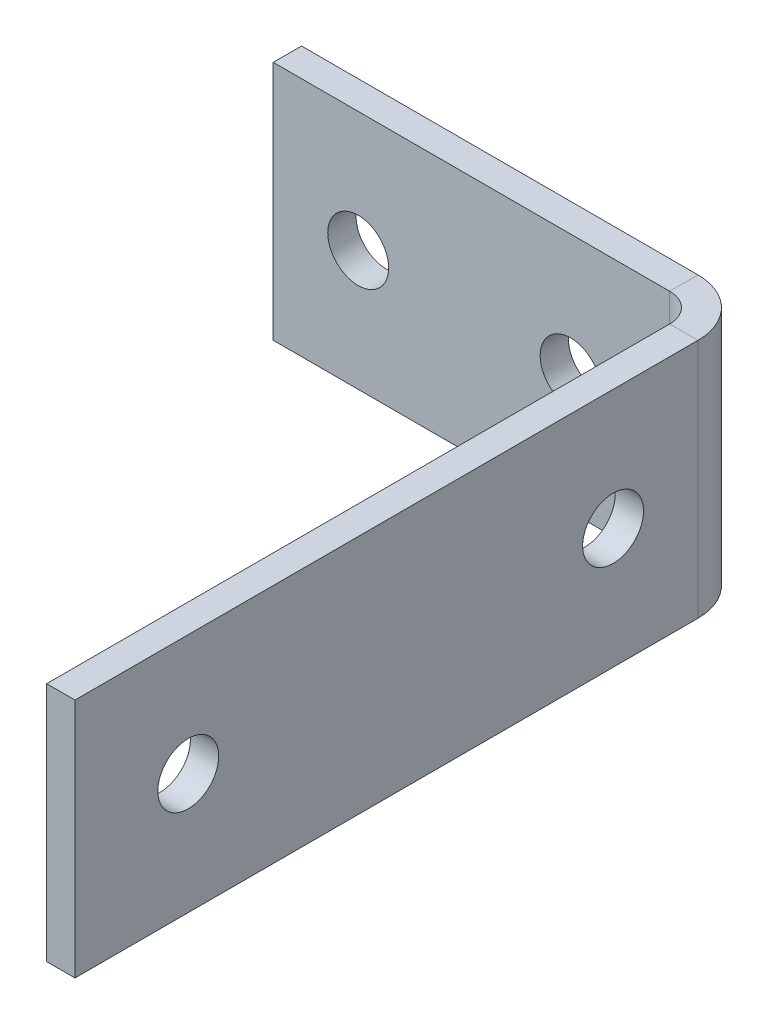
ISO-10303-21;
HEADER;
FILE_DESCRIPTION(('STEP AP214'),'2;1');
FILE_NAME('part.step','',(''),(''),'','','');
FILE_SCHEMA(('AUTOMOTIVE_DESIGN { 1 0 10303 214 1 1 1 1 }'));
ENDSEC;
DATA;
#1=APPLICATION_CONTEXT('core data for automotive mechanical design processes');
#2=APPLICATION_PROTOCOL_DEFINITION('international standard','automotive_design',2000,#1);
#3=PRODUCT_CONTEXT('',#1,'mechanical');
#4=PRODUCT('Part','Part','',(#3));
#5=PRODUCT_RELATED_PRODUCT_CATEGORY('part','',(#4));
#6=PRODUCT_DEFINITION_FORMATION('','',#4);
#7=PRODUCT_DEFINITION_CONTEXT('part definition',#1,'design');
#8=PRODUCT_DEFINITION('design','',#6,#7);
#9=PRODUCT_DEFINITION_SHAPE('','',#8);
#10=(LENGTH_UNIT() NAMED_UNIT(*) SI_UNIT(.MILLI.,.METRE.));
#11=(NAMED_UNIT(*) PLANE_ANGLE_UNIT() SI_UNIT($,.RADIAN.));
#12=(NAMED_UNIT(*) SI_UNIT($,.STERADIAN.) SOLID_ANGLE_UNIT());
#13=UNCERTAINTY_MEASURE_WITH_UNIT(LENGTH_MEASURE(1.E-05),#10,'distance_accuracy_value','');
#14=(GEOMETRIC_REPRESENTATION_CONTEXT(3) GLOBAL_UNCERTAINTY_ASSIGNED_CONTEXT((#13)) GLOBAL_UNIT_ASSIGNED_CONTEXT((#10,
#11,#12)) REPRESENTATION_CONTEXT('',''));
#15=CARTESIAN_POINT('',(0.,0.,0.));
#16=DIRECTION('',(0.,0.,1.));
#17=DIRECTION('',(1.,0.,0.));
#18=AXIS2_PLACEMENT_3D('',#15,#16,#17);
#19=CARTESIAN_POINT('',(-16.,8.5,-2.));
#20=DIRECTION('',(0.,1.,0.));
#21=DIRECTION('',(0.,0.,1.));
#22=AXIS2_PLACEMENT_3D('',#19,#20,#21);
#23=PLANE('',#22);
#24=DIRECTION('',(-1.,0.,0.));
#25=VECTOR('',#24,1.);
#26=CARTESIAN_POINT('',(-16.,8.5,0.));
#27=LINE('',#26,#25);
#28=CARTESIAN_POINT('',(12.,8.5,0.));
#29=VERTEX_POINT('',#28);
#30=CARTESIAN_POINT('',(-16.,8.5,0.));
#31=VERTEX_POINT('',#30);
#32=EDGE_CURVE('E101',#29,#31,#27,.T.);
#33=ORIENTED_EDGE('',*,*,#32,.F.);
#34=DIRECTION('',(0.,0.,-1.));
#35=VECTOR('',#34,1.);
#36=CARTESIAN_POINT('',(12.,8.5,0.));
#37=LINE('',#36,#35);
#38=CARTESIAN_POINT('',(12.,8.5,-2.));
#39=VERTEX_POINT('',#38);
#40=EDGE_CURVE('E116',#29,#39,#37,.T.);
#41=ORIENTED_EDGE('',*,*,#40,.T.);
#42=DIRECTION('',(-1.,0.,0.));
#43=VECTOR('',#42,1.);
#44=CARTESIAN_POINT('',(-16.,8.5,-2.));
#45=LINE('',#44,#43);
#46=CARTESIAN_POINT('',(-16.,8.5,-2.));
#47=VERTEX_POINT('',#46);
#48=EDGE_CURVE('E108',#39,#47,#45,.T.);
#49=ORIENTED_EDGE('',*,*,#48,.T.);
#50=DIRECTION('',(0.,0.,1.));
#51=VECTOR('',#50,1.);
#52=CARTESIAN_POINT('',(-16.,8.5,-2.));
#53=LINE('',#52,#51);
#54=EDGE_CURVE('E62',#47,#31,#53,.T.);
#55=ORIENTED_EDGE('',*,*,#54,.T.);
#56=EDGE_LOOP('',(#33,#41,#49,#55));
#57=FACE_BOUND('',#56,.T.);
#58=ADVANCED_FACE('F59',(#57),#23,.T.);
#59=CARTESIAN_POINT('',(0.,0.,-2.));
#60=DIRECTION('',(0.,0.,1.));
#61=DIRECTION('',(1.,0.,0.));
#62=AXIS2_PLACEMENT_3D('',#59,#60,#61);
#63=PLANE('',#62);
#64=CARTESIAN_POINT('',(-9.99999999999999,0.,-2.));
#65=DIRECTION('',(0.,0.,-1.));
#66=DIRECTION('',(-1.,0.,0.));
#67=AXIS2_PLACEMENT_3D('',#64,#65,#66);
#68=CIRCLE('',#67,2.15);
#69=CARTESIAN_POINT('',(-12.15,0.,-2.));
#70=VERTEX_POINT('',#69);
#71=EDGE_CURVE('E176',#70,#70,#68,.T.);
#72=ORIENTED_EDGE('',*,*,#71,.F.);
#73=EDGE_LOOP('',(#72));
#74=FACE_BOUND('',#73,.T.);
#75=CARTESIAN_POINT('',(5.00000000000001,0.,-2.));
#76=DIRECTION('',(0.,0.,-1.));
#77=DIRECTION('',(-1.,0.,0.));
#78=AXIS2_PLACEMENT_3D('',#75,#76,#77);
#79=CIRCLE('',#78,2.15);
#80=CARTESIAN_POINT('',(2.85000000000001,0.,-2.));
#81=VERTEX_POINT('',#80);
#82=EDGE_CURVE('E141',#81,#81,#79,.T.);
#83=ORIENTED_EDGE('',*,*,#82,.F.);
#84=EDGE_LOOP('',(#83));
#85=FACE_BOUND('',#84,.T.);
#86=DIRECTION('',(0.,1.,0.));
#87=VECTOR('',#86,1.);
#88=CARTESIAN_POINT('',(12.,8.5,-2.));
#89=LINE('',#88,#87);
#90=CARTESIAN_POINT('',(12.,-8.49999999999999,-2.));
#91=VERTEX_POINT('',#90);
#92=EDGE_CURVE('E132',#39,#91,#89,.F.);
#93=ORIENTED_EDGE('',*,*,#92,.T.);
#94=DIRECTION('',(1.,0.,0.));
#95=VECTOR('',#94,1.);
#96=CARTESIAN_POINT('',(-16.,-8.5,-2.));
#97=LINE('',#96,#95);
#98=CARTESIAN_POINT('',(-16.,-8.5,-2.));
#99=VERTEX_POINT('',#98);
#100=EDGE_CURVE('E113',#99,#91,#97,.T.);
#101=ORIENTED_EDGE('',*,*,#100,.F.);
#102=DIRECTION('',(0.,-1.,0.));
#103=VECTOR('',#102,1.);
#104=CARTESIAN_POINT('',(-16.,8.5,-2.));
#105=LINE('',#104,#103);
#106=EDGE_CURVE('E96',#47,#99,#105,.T.);
#107=ORIENTED_EDGE('',*,*,#106,.F.);
#108=ORIENTED_EDGE('',*,*,#48,.F.);
#109=EDGE_LOOP('',(#93,#101,#107,#108));
#110=FACE_BOUND('',#109,.T.);
#111=ADVANCED_FACE('F245',(#74,#85,#110),#63,.F.);
#112=CARTESIAN_POINT('',(0.,0.,0.));
#113=DIRECTION('',(0.,0.,1.));
#114=DIRECTION('',(1.,0.,0.));
#115=AXIS2_PLACEMENT_3D('',#112,#113,#114);
#116=PLANE('',#115);
#117=CARTESIAN_POINT('',(-9.99999999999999,0.,0.));
#118=DIRECTION('',(0.,0.,1.));
#119=DIRECTION('',(1.,0.,0.));
#120=AXIS2_PLACEMENT_3D('',#117,#118,#119);
#121=CIRCLE('',#120,2.15);
#122=CARTESIAN_POINT('',(-7.84999999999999,0.,0.));
#123=VERTEX_POINT('',#122);
#124=EDGE_CURVE('E179',#123,#123,#121,.F.);
#125=ORIENTED_EDGE('',*,*,#124,.T.);
#126=EDGE_LOOP('',(#125));
#127=FACE_BOUND('',#126,.T.);
#128=CARTESIAN_POINT('',(5.00000000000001,0.,0.));
#129=DIRECTION('',(0.,0.,1.));
#130=DIRECTION('',(1.,0.,0.));
#131=AXIS2_PLACEMENT_3D('',#128,#129,#130);
#132=CIRCLE('',#131,2.15);
#133=CARTESIAN_POINT('',(7.15000000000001,0.,0.));
#134=VERTEX_POINT('',#133);
#135=EDGE_CURVE('E173',#134,#134,#132,.F.);
#136=ORIENTED_EDGE('',*,*,#135,.T.);
#137=EDGE_LOOP('',(#136));
#138=FACE_BOUND('',#137,.T.);
#139=DIRECTION('',(1.,0.,0.));
#140=VECTOR('',#139,1.);
#141=CARTESIAN_POINT('',(-16.,-8.5,0.));
#142=LINE('',#141,#140);
#143=CARTESIAN_POINT('',(-16.,-8.5,0.));
#144=VERTEX_POINT('',#143);
#145=CARTESIAN_POINT('',(12.,-8.5,0.));
#146=VERTEX_POINT('',#145);
#147=EDGE_CURVE('E100',#144,#146,#142,.T.);
#148=ORIENTED_EDGE('',*,*,#147,.T.);
#149=DIRECTION('',(0.,1.,0.));
#150=VECTOR('',#149,1.);
#151=CARTESIAN_POINT('',(12.,8.5,0.));
#152=LINE('',#151,#150);
#153=EDGE_CURVE('E73',#29,#146,#152,.F.);
#154=ORIENTED_EDGE('',*,*,#153,.F.);
#155=ORIENTED_EDGE('',*,*,#32,.T.);
#156=DIRECTION('',(0.,-1.,0.));
#157=VECTOR('',#156,1.);
#158=CARTESIAN_POINT('',(-16.,8.5,0.));
#159=LINE('',#158,#157);
#160=EDGE_CURVE('E94',#31,#144,#159,.T.);
#161=ORIENTED_EDGE('',*,*,#160,.T.);
#162=EDGE_LOOP('',(#148,#154,#155,#161));
#163=FACE_BOUND('',#162,.T.);
#164=ADVANCED_FACE('F98',(#127,#138,#163),#116,.T.);
#165=CARTESIAN_POINT('',(-16.,-8.5,-2.));
#166=DIRECTION('',(0.,-1.,0.));
#167=DIRECTION('',(0.,0.,-1.));
#168=AXIS2_PLACEMENT_3D('',#165,#166,#167);
#169=PLANE('',#168);
#170=DIRECTION('',(0.,0.,-1.));
#171=VECTOR('',#170,1.);
#172=CARTESIAN_POINT('',(12.,-8.5,0.));
#173=LINE('',#172,#171);
#174=EDGE_CURVE('E107',#146,#91,#173,.T.);
#175=ORIENTED_EDGE('',*,*,#174,.F.);
#176=ORIENTED_EDGE('',*,*,#147,.F.);
#177=DIRECTION('',(0.,0.,1.));
#178=VECTOR('',#177,1.);
#179=CARTESIAN_POINT('',(-16.,-8.5,-2.));
#180=LINE('',#179,#178);
#181=EDGE_CURVE('E13',#99,#144,#180,.T.);
#182=ORIENTED_EDGE('',*,*,#181,.F.);
#183=ORIENTED_EDGE('',*,*,#100,.T.);
#184=EDGE_LOOP('',(#175,#176,#182,#183));
#185=FACE_BOUND('',#184,.T.);
#186=ADVANCED_FACE('F105',(#185),#169,.T.);
#187=CARTESIAN_POINT('',(-16.,8.5,-2.));
#188=DIRECTION('',(-1.,0.,0.));
#189=DIRECTION('',(0.,0.,1.));
#190=AXIS2_PLACEMENT_3D('',#187,#188,#189);
#191=PLANE('',#190);
#192=ORIENTED_EDGE('',*,*,#160,.F.);
#193=ORIENTED_EDGE('',*,*,#54,.F.);
#194=ORIENTED_EDGE('',*,*,#106,.T.);
#195=ORIENTED_EDGE('',*,*,#181,.T.);
#196=EDGE_LOOP('',(#192,#193,#194,#195));
#197=FACE_BOUND('',#196,.T.);
#198=ADVANCED_FACE('F92',(#197),#191,.T.);
#199=CARTESIAN_POINT('',(12.,-8.5,2.));
#200=DIRECTION('',(0.,-1.,0.));
#201=DIRECTION('',(0.,0.,-1.));
#202=AXIS2_PLACEMENT_3D('',#199,#200,#201);
#203=PLANE('',#202);
#204=DIRECTION('',(-1.,0.,0.));
#205=VECTOR('',#204,1.);
#206=CARTESIAN_POINT('',(16.,-8.5,1.99999999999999));
#207=LINE('',#206,#205);
#208=CARTESIAN_POINT('',(14.,-8.5,1.99999999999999));
#209=VERTEX_POINT('',#208);
#210=CARTESIAN_POINT('',(16.,-8.5,1.99999999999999));
#211=VERTEX_POINT('',#210);
#212=EDGE_CURVE('E137',#209,#211,#207,.F.);
#213=ORIENTED_EDGE('',*,*,#212,.F.);
#214=CARTESIAN_POINT('',(12.,-8.5,2.));
#215=DIRECTION('',(0.,1.,0.));
#216=DIRECTION('',(0.,0.,1.));
#217=AXIS2_PLACEMENT_3D('',#214,#215,#216);
#218=CIRCLE('',#217,2.);
#219=EDGE_CURVE('E126',#146,#209,#218,.F.);
#220=ORIENTED_EDGE('',*,*,#219,.F.);
#221=ORIENTED_EDGE('',*,*,#174,.T.);
#222=CARTESIAN_POINT('',(12.,-8.5,2.));
#223=DIRECTION('',(0.,1.,0.));
#224=DIRECTION('',(0.,0.,1.));
#225=AXIS2_PLACEMENT_3D('',#222,#223,#224);
#226=CIRCLE('',#225,4.);
#227=EDGE_CURVE('E119',#91,#211,#226,.F.);
#228=ORIENTED_EDGE('',*,*,#227,.T.);
#229=EDGE_LOOP('',(#213,#220,#221,#228));
#230=FACE_BOUND('',#229,.T.);
#231=ADVANCED_FACE('F248',(#230),#203,.T.);
#232=CARTESIAN_POINT('',(12.,8.5,2.));
#233=DIRECTION('',(0.,-1.,0.));
#234=DIRECTION('',(0.,0.,-1.));
#235=AXIS2_PLACEMENT_3D('',#232,#233,#234);
#236=PLANE('',#235);
#237=CARTESIAN_POINT('',(12.,8.5,2.));
#238=DIRECTION('',(0.,1.,0.));
#239=DIRECTION('',(0.,0.,1.));
#240=AXIS2_PLACEMENT_3D('',#237,#238,#239);
#241=CIRCLE('',#240,2.);
#242=CARTESIAN_POINT('',(14.,8.5,1.99999999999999));
#243=VERTEX_POINT('',#242);
#244=EDGE_CURVE('E121',#243,#29,#241,.T.);
#245=ORIENTED_EDGE('',*,*,#244,.F.);
#246=DIRECTION('',(-1.,0.,0.));
#247=VECTOR('',#246,1.);
#248=CARTESIAN_POINT('',(14.,8.5,1.99999999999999));
#249=LINE('',#248,#247);
#250=CARTESIAN_POINT('',(16.,8.5,1.99999999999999));
#251=VERTEX_POINT('',#250);
#252=EDGE_CURVE('E144',#243,#251,#249,.F.);
#253=ORIENTED_EDGE('',*,*,#252,.T.);
#254=CARTESIAN_POINT('',(12.,8.5,2.));
#255=DIRECTION('',(0.,1.,0.));
#256=DIRECTION('',(0.,0.,1.));
#257=AXIS2_PLACEMENT_3D('',#254,#255,#256);
#258=CIRCLE('',#257,4.);
#259=EDGE_CURVE('E129',#251,#39,#258,.T.);
#260=ORIENTED_EDGE('',*,*,#259,.T.);
#261=ORIENTED_EDGE('',*,*,#40,.F.);
#262=EDGE_LOOP('',(#245,#253,#260,#261));
#263=FACE_BOUND('',#262,.T.);
#264=ADVANCED_FACE('F252',(#263),#236,.F.);
#265=CARTESIAN_POINT('',(12.,8.5,2.));
#266=DIRECTION('',(0.,1.,0.));
#267=DIRECTION('',(1.,0.,0.));
#268=AXIS2_PLACEMENT_3D('',#265,#266,#267);
#269=CYLINDRICAL_SURFACE('',#268,4.);
#270=ORIENTED_EDGE('',*,*,#92,.F.);
#271=ORIENTED_EDGE('',*,*,#259,.F.);
#272=DIRECTION('',(0.,1.,0.));
#273=VECTOR('',#272,1.);
#274=CARTESIAN_POINT('',(16.,-8.5,1.99999999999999));
#275=LINE('',#274,#273);
#276=EDGE_CURVE('E147',#251,#211,#275,.F.);
#277=ORIENTED_EDGE('',*,*,#276,.T.);
#278=ORIENTED_EDGE('',*,*,#227,.F.);
#279=EDGE_LOOP('',(#270,#271,#277,#278));
#280=FACE_BOUND('',#279,.T.);
#281=ADVANCED_FACE('F249',(#280),#269,.T.);
#282=CARTESIAN_POINT('',(12.,8.5,2.));
#283=DIRECTION('',(0.,1.,0.));
#284=DIRECTION('',(1.,0.,0.));
#285=AXIS2_PLACEMENT_3D('',#282,#283,#284);
#286=CYLINDRICAL_SURFACE('',#285,2.);
#287=ORIENTED_EDGE('',*,*,#153,.T.);
#288=ORIENTED_EDGE('',*,*,#219,.T.);
#289=DIRECTION('',(0.,1.,0.));
#290=VECTOR('',#289,1.);
#291=CARTESIAN_POINT('',(14.,-8.5,1.99999999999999));
#292=LINE('',#291,#290);
#293=EDGE_CURVE('E140',#209,#243,#292,.T.);
#294=ORIENTED_EDGE('',*,*,#293,.T.);
#295=ORIENTED_EDGE('',*,*,#244,.T.);
#296=EDGE_LOOP('',(#287,#288,#294,#295));
#297=FACE_BOUND('',#296,.T.);
#298=ADVANCED_FACE('F251',(#297),#286,.F.);
#299=CARTESIAN_POINT('',(16.,-8.5,0.));
#300=DIRECTION('',(0.,1.,0.));
#301=DIRECTION('',(0.,0.,1.));
#302=AXIS2_PLACEMENT_3D('',#299,#300,#301);
#303=PLANE('',#302);
#304=ORIENTED_EDGE('',*,*,#212,.T.);
#305=DIRECTION('',(0.,0.,-1.));
#306=VECTOR('',#305,1.);
#307=CARTESIAN_POINT('',(16.,-8.5,0.));
#308=LINE('',#307,#306);
#309=CARTESIAN_POINT('',(16.0000000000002,-8.5,46.));
#310=VERTEX_POINT('',#309);
#311=EDGE_CURVE('E159',#310,#211,#308,.T.);
#312=ORIENTED_EDGE('',*,*,#311,.F.);
#313=DIRECTION('',(-1.,0.,0.));
#314=VECTOR('',#313,1.);
#315=CARTESIAN_POINT('',(16.0000000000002,-8.5,46.));
#316=LINE('',#315,#314);
#317=CARTESIAN_POINT('',(14.0000000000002,-8.5,46.));
#318=VERTEX_POINT('',#317);
#319=EDGE_CURVE('E168',#310,#318,#316,.T.);
#320=ORIENTED_EDGE('',*,*,#319,.T.);
#321=DIRECTION('',(0.,0.,1.));
#322=VECTOR('',#321,1.);
#323=CARTESIAN_POINT('',(14.,-8.5,0.));
#324=LINE('',#323,#322);
#325=EDGE_CURVE('E150',#318,#209,#324,.F.);
#326=ORIENTED_EDGE('',*,*,#325,.T.);
#327=EDGE_LOOP('',(#304,#312,#320,#326));
#328=FACE_BOUND('',#327,.T.);
#329=ADVANCED_FACE('F258',(#328),#303,.F.);
#330=CARTESIAN_POINT('',(16.0000000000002,8.5,46.));
#331=DIRECTION('',(0.,-1.,0.));
#332=DIRECTION('',(0.,0.,-1.));
#333=AXIS2_PLACEMENT_3D('',#330,#331,#332);
#334=PLANE('',#333);
#335=ORIENTED_EDGE('',*,*,#252,.F.);
#336=DIRECTION('',(0.,0.,-1.));
#337=VECTOR('',#336,1.);
#338=CARTESIAN_POINT('',(14.0000000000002,8.5,46.));
#339=LINE('',#338,#337);
#340=CARTESIAN_POINT('',(14.0000000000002,8.5,46.));
#341=VERTEX_POINT('',#340);
#342=EDGE_CURVE('E153',#243,#341,#339,.F.);
#343=ORIENTED_EDGE('',*,*,#342,.T.);
#344=DIRECTION('',(-1.,0.,0.));
#345=VECTOR('',#344,1.);
#346=CARTESIAN_POINT('',(16.0000000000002,8.5,46.));
#347=LINE('',#346,#345);
#348=CARTESIAN_POINT('',(16.0000000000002,8.5,46.));
#349=VERTEX_POINT('',#348);
#350=EDGE_CURVE('E124',#349,#341,#347,.T.);
#351=ORIENTED_EDGE('',*,*,#350,.F.);
#352=DIRECTION('',(0.,0.,1.));
#353=VECTOR('',#352,1.);
#354=CARTESIAN_POINT('',(16.,8.5,0.));
#355=LINE('',#354,#353);
#356=EDGE_CURVE('E162',#251,#349,#355,.T.);
#357=ORIENTED_EDGE('',*,*,#356,.F.);
#358=EDGE_LOOP('',(#335,#343,#351,#357));
#359=FACE_BOUND('',#358,.T.);
#360=ADVANCED_FACE('F203',(#359),#334,.F.);
#361=CARTESIAN_POINT('',(16.,0.,0.));
#362=DIRECTION('',(-1.,0.,0.));
#363=DIRECTION('',(0.,0.,1.));
#364=AXIS2_PLACEMENT_3D('',#361,#362,#363);
#365=PLANE('',#364);
#366=CARTESIAN_POINT('',(16.0000000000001,0.,38.));
#367=DIRECTION('',(1.,0.,0.));
#368=DIRECTION('',(0.,0.,-1.));
#369=AXIS2_PLACEMENT_3D('',#366,#367,#368);
#370=CIRCLE('',#369,2.15);
#371=CARTESIAN_POINT('',(16.0000000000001,0.,35.85));
#372=VERTEX_POINT('',#371);
#373=EDGE_CURVE('E188',#372,#372,#370,.T.);
#374=ORIENTED_EDGE('',*,*,#373,.F.);
#375=EDGE_LOOP('',(#374));
#376=FACE_BOUND('',#375,.T.);
#377=CARTESIAN_POINT('',(16.,0.,7.99999999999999));
#378=DIRECTION('',(1.,0.,0.));
#379=DIRECTION('',(0.,0.,-1.));
#380=AXIS2_PLACEMENT_3D('',#377,#378,#379);
#381=CIRCLE('',#380,2.15);
#382=CARTESIAN_POINT('',(16.,0.,5.84999999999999));
#383=VERTEX_POINT('',#382);
#384=EDGE_CURVE('E182',#383,#383,#381,.T.);
#385=ORIENTED_EDGE('',*,*,#384,.F.);
#386=EDGE_LOOP('',(#385));
#387=FACE_BOUND('',#386,.T.);
#388=ORIENTED_EDGE('',*,*,#276,.F.);
#389=ORIENTED_EDGE('',*,*,#356,.T.);
#390=DIRECTION('',(0.,-1.,0.));
#391=VECTOR('',#390,1.);
#392=CARTESIAN_POINT('',(16.0000000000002,0.,46.));
#393=LINE('',#392,#391);
#394=EDGE_CURVE('E165',#349,#310,#393,.T.);
#395=ORIENTED_EDGE('',*,*,#394,.T.);
#396=ORIENTED_EDGE('',*,*,#311,.T.);
#397=EDGE_LOOP('',(#388,#389,#395,#396));
#398=FACE_BOUND('',#397,.T.);
#399=ADVANCED_FACE('F199',(#376,#387,#398),#365,.F.);
#400=CARTESIAN_POINT('',(14.,0.,0.));
#401=DIRECTION('',(-1.,0.,0.));
#402=DIRECTION('',(0.,0.,1.));
#403=AXIS2_PLACEMENT_3D('',#400,#401,#402);
#404=PLANE('',#403);
#405=CARTESIAN_POINT('',(14.0000000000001,0.,38.));
#406=DIRECTION('',(-1.,0.,0.));
#407=DIRECTION('',(0.,0.,1.));
#408=AXIS2_PLACEMENT_3D('',#405,#406,#407);
#409=CIRCLE('',#408,2.15);
#410=CARTESIAN_POINT('',(14.0000000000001,0.,40.15));
#411=VERTEX_POINT('',#410);
#412=EDGE_CURVE('E191',#411,#411,#409,.F.);
#413=ORIENTED_EDGE('',*,*,#412,.T.);
#414=EDGE_LOOP('',(#413));
#415=FACE_BOUND('',#414,.T.);
#416=CARTESIAN_POINT('',(14.,0.,7.99999999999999));
#417=DIRECTION('',(-1.,0.,0.));
#418=DIRECTION('',(0.,0.,1.));
#419=AXIS2_PLACEMENT_3D('',#416,#417,#418);
#420=CIRCLE('',#419,2.15);
#421=CARTESIAN_POINT('',(14.,0.,10.15));
#422=VERTEX_POINT('',#421);
#423=EDGE_CURVE('E185',#422,#422,#420,.F.);
#424=ORIENTED_EDGE('',*,*,#423,.T.);
#425=EDGE_LOOP('',(#424));
#426=FACE_BOUND('',#425,.T.);
#427=ORIENTED_EDGE('',*,*,#342,.F.);
#428=ORIENTED_EDGE('',*,*,#293,.F.);
#429=ORIENTED_EDGE('',*,*,#325,.F.);
#430=DIRECTION('',(0.,1.,0.));
#431=VECTOR('',#430,1.);
#432=CARTESIAN_POINT('',(14.0000000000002,-8.5,46.));
#433=LINE('',#432,#431);
#434=EDGE_CURVE('E156',#341,#318,#433,.F.);
#435=ORIENTED_EDGE('',*,*,#434,.F.);
#436=EDGE_LOOP('',(#427,#428,#429,#435));
#437=FACE_BOUND('',#436,.T.);
#438=ADVANCED_FACE('F202',(#415,#426,#437),#404,.T.);
#439=CARTESIAN_POINT('',(16.0000000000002,-8.5,46.));
#440=DIRECTION('',(0.,0.,-1.));
#441=DIRECTION('',(-1.,0.,0.));
#442=AXIS2_PLACEMENT_3D('',#439,#440,#441);
#443=PLANE('',#442);
#444=ORIENTED_EDGE('',*,*,#434,.T.);
#445=ORIENTED_EDGE('',*,*,#319,.F.);
#446=ORIENTED_EDGE('',*,*,#394,.F.);
#447=ORIENTED_EDGE('',*,*,#350,.T.);
#448=EDGE_LOOP('',(#444,#445,#446,#447));
#449=FACE_BOUND('',#448,.T.);
#450=ADVANCED_FACE('F230',(#449),#443,.F.);
#451=CARTESIAN_POINT('',(5.00000000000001,0.,46.001));
#452=DIRECTION('',(0.,0.,-1.));
#453=DIRECTION('',(-1.,0.,0.));
#454=AXIS2_PLACEMENT_3D('',#451,#452,#453);
#455=CYLINDRICAL_SURFACE('',#454,2.15);
#456=ORIENTED_EDGE('',*,*,#135,.F.);
#457=EDGE_LOOP('',(#456));
#458=FACE_BOUND('',#457,.T.);
#459=ORIENTED_EDGE('',*,*,#82,.T.);
#460=EDGE_LOOP('',(#459));
#461=FACE_BOUND('',#460,.T.);
#462=ADVANCED_FACE('F285',(#458,#461),#455,.F.);
#463=CARTESIAN_POINT('',(-9.99999999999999,0.,46.001));
#464=DIRECTION('',(0.,0.,-1.));
#465=DIRECTION('',(-1.,0.,0.));
#466=AXIS2_PLACEMENT_3D('',#463,#464,#465);
#467=CYLINDRICAL_SURFACE('',#466,2.15);
#468=ORIENTED_EDGE('',*,*,#124,.F.);
#469=EDGE_LOOP('',(#468));
#470=FACE_BOUND('',#469,.T.);
#471=ORIENTED_EDGE('',*,*,#71,.T.);
#472=EDGE_LOOP('',(#471));
#473=FACE_BOUND('',#472,.T.);
#474=ADVANCED_FACE('F291',(#470,#473),#467,.F.);
#475=CARTESIAN_POINT('',(-16.0010000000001,0.,8.0000000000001));
#476=DIRECTION('',(1.,0.,0.));
#477=DIRECTION('',(0.,0.,-1.));
#478=AXIS2_PLACEMENT_3D('',#475,#476,#477);
#479=CYLINDRICAL_SURFACE('',#478,2.15);
#480=ORIENTED_EDGE('',*,*,#423,.F.);
#481=EDGE_LOOP('',(#480));
#482=FACE_BOUND('',#481,.T.);
#483=ORIENTED_EDGE('',*,*,#384,.T.);
#484=EDGE_LOOP('',(#483));
#485=FACE_BOUND('',#484,.T.);
#486=ADVANCED_FACE('F295',(#482,#485),#479,.F.);
#487=CARTESIAN_POINT('',(-16.001,0.,38.0000000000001));
#488=DIRECTION('',(1.,0.,0.));
#489=DIRECTION('',(0.,0.,-1.));
#490=AXIS2_PLACEMENT_3D('',#487,#488,#489);
#491=CYLINDRICAL_SURFACE('',#490,2.15);
#492=ORIENTED_EDGE('',*,*,#412,.F.);
#493=EDGE_LOOP('',(#492));
#494=FACE_BOUND('',#493,.T.);
#495=ORIENTED_EDGE('',*,*,#373,.T.);
#496=EDGE_LOOP('',(#495));
#497=FACE_BOUND('',#496,.T.);
#498=ADVANCED_FACE('F197',(#494,#497),#491,.F.);
#499=CLOSED_SHELL('',(#58,#111,#164,#186,#198,#231,#264,#281,#298,#329,#360,#399,#438,#450,#462,
#474,#486,#498));
#500=MANIFOLD_SOLID_BREP('B2',#499);
#501=ADVANCED_BREP_SHAPE_REPRESENTATION('',(#18,#500),#14);
#502=SHAPE_DEFINITION_REPRESENTATION(#9,#501);
ENDSEC;
END-ISO-10303-21;
